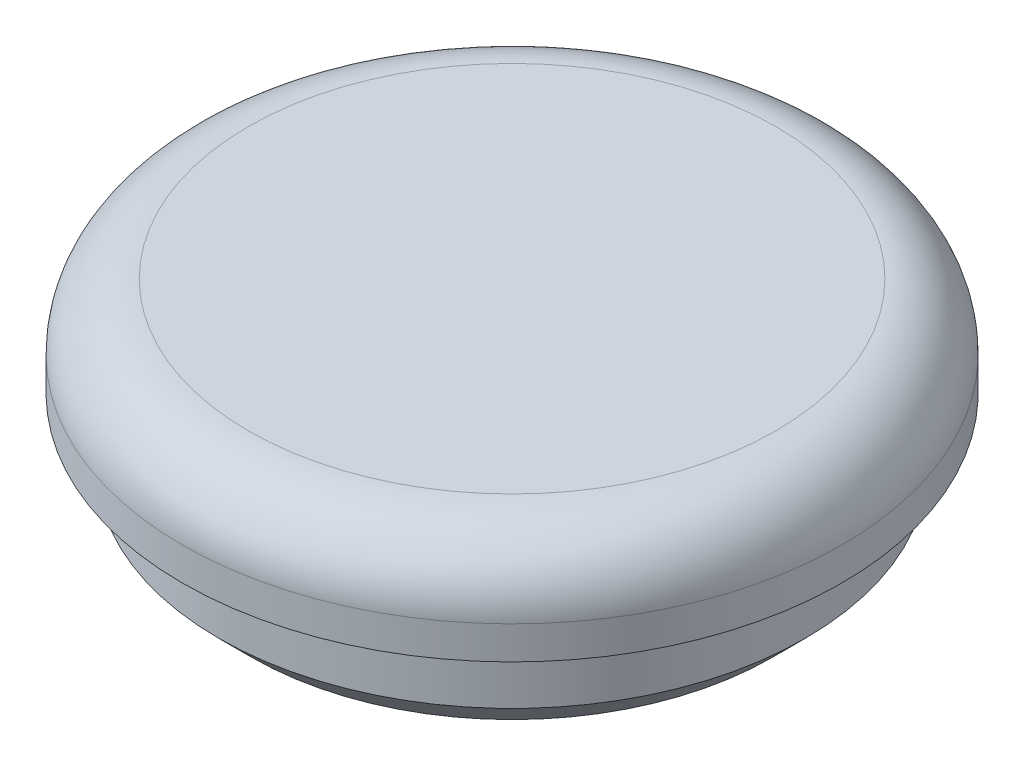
from build123d import *


with BuildPart() as part:
    # Esquisse1 → R_volution1 (revolve)
    with BuildSketch(Plane.XY, mode=Mode.PRIVATE) as r_volution1_sk:
        with BuildLine():
            Line((0, 0), (4, 0))
            ThreePointArc((4, 0), (4.707106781, -0.292893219), (5, -1))
            Line((5, -1), (5, -1.5))
            Line((5, -1.5), (4.45, -1.5))
            Line((4.45, -1.5), (4.45, -2.5))
            Line((4.45, -2.5), (3.95, -3))
            Line((3.95, -3), (0, -3))
            Line((0, -3), (0, 0))
        make_face()
    revolve(r_volution1_sk.sketch.rotate(Axis((0, 5.03649635, 0), (0, -1, 0)), 90), axis=Axis((0, 5.03649635, 0), (0, -1, 0)))


solid = part.part
